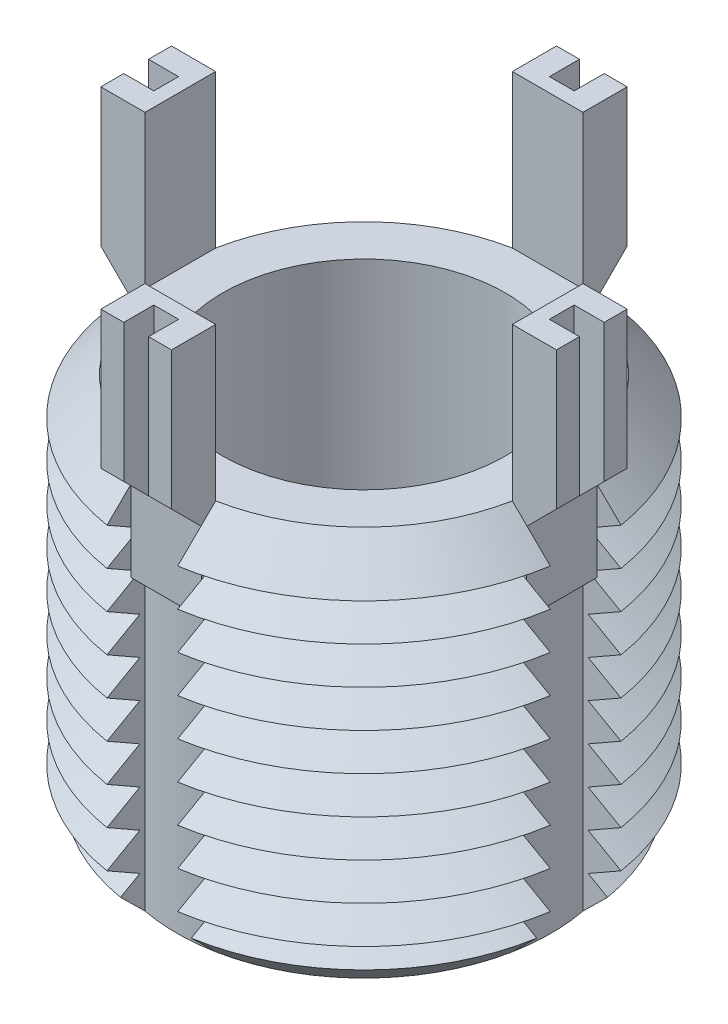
from build123d import *

# Parameters (mm, degrees)
SKETCH1_R           = 12.7
BOSS_EXTRUDE1_DEPTH = 22.098
CHAMFER1_SIZE       = 2.117
LPATTERN1_COUNT     = 9
LPATTERN1_PITCH     = 2.117
CUT_EXTRUDE1_REACH  = 30.476
CIRPATTERN1_COUNT   = 4
BOSS_EXTRUDE3_DEPTH = 2
CIRPATTERN2_COUNT   = 4
CUT_EXTRUDE3_REACH  = 37.746
SKETCH6_W           = 1.7
SKETCH6_H           = 1.4
SKETCH6_W_2         = 1.4
SKETCH6_H_2         = 1.7
SKETCH7_R           = 8
CUT_EXTRUDE4_DEPTH  = 22.098


with BuildPart() as part:
    # Sketch1 → Boss-Extrude1 (new body)
    with BuildSketch(Plane(origin=(0, 0, 0), x_dir=(1, 0, 0), z_dir=(0, 1, 0))):
        with Locations(Location((0, 0, 0), (0, 0, 270))):
            Circle(SKETCH1_R)
    extrude(amount=-BOSS_EXTRUDE1_DEPTH)

    # Chamfer1
    chamfer1_edges = [part.edges().sort_by_distance(p)[0] for p in [
        (0, 0, -12.7),
        (0, -22.098, -12.7),
    ]]
    chamfer(chamfer1_edges, length=CHAMFER1_SIZE)

    # Sketch3 → Cut-Revolve1 (revolve, cut)
    with BuildSketch(Plane(origin=(0, 0, 0), x_dir=(0, 0, -1), z_dir=(1, 0, 0))):
        Polygon((-12.7, -2.117), (-10.86662422, -3.1755), (-12.7, -4.234), align=None)
    cut_revolve1 = revolve(axis=Axis((0, 0.885892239, 0), (0, -1, 0)), mode=Mode.SUBTRACT)

    # LPattern1: Cut-Revolve1 ×9
    with Locations(*[(0, -i * LPATTERN1_PITCH, 0) for i in range(1, LPATTERN1_COUNT)]):
        add(cut_revolve1, mode=Mode.SUBTRACT)

    # Cut-Extrude1: up to this cone (the profile starts inside it)
    cut_extrude1_end = Plane(origin=(0, 0, 0), z_dir=(0, 1, 0)).offset(-32.680999) * Cone(1e-06, 96.338, 96.337999, align=(Align.CENTER, Align.CENTER, Align.MIN), mode=Mode.PRIVATE)
    # Sketch4 → Cut-Extrude1 (cut, up to the surface)
    with BuildSketch(Plane(origin=(0, 0, 0), x_dir=(1, 0, 0), z_dir=(0, 1, 0)), mode=Mode.PRIVATE) as cut_extrude1_sk1:
        with BuildLine():
            Line((-10.392299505, 2), (-12.541531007, 2))
            ThreePointArc((-12.541531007, 2), (-12.7, 0), (-12.541531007, -2))
            Line((-12.541531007, -2), (-10.392299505, -2))
            ThreePointArc((-10.392299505, -2), (-10.583, 0), (-10.392299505, 2))
        make_face()
    cut_extrude1_tool1 = extrude(cut_extrude1_sk1.sketch, amount=-CUT_EXTRUDE1_REACH, mode=Mode.PRIVATE) & cut_extrude1_end
    cut_extrude1 = cut_extrude1_tool1.solids().sort_by_distance((-11.583253, 0, 0))[0]
    add(cut_extrude1, mode=Mode.SUBTRACT)

    # CirPattern1: Cut-Extrude1 ×4 about axis
    cirpattern1_axis = Axis((0, 0, 0), (0, 1, 0))
    for i in range(1, CIRPATTERN1_COUNT):
        add(cut_extrude1.rotate(cirpattern1_axis, i * 360 / CIRPATTERN1_COUNT), mode=Mode.SUBTRACT)

    # Sketch5 → Boss-Extrude3 (add, symmetric)
    with BuildSketch(Plane(origin=(0, 0, 0), x_dir=(0, 0, -1), z_dir=(1, 0, 0))):
        Polygon((-10.392299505, 8.649), (-10.392299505, -5.351), (-11.192299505, -5.351), (-11.192299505, -0.851), (-12.892299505, 0.849), (-12.892299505, 8.649), align=None)
    boss_extrude3 = extrude(amount=BOSS_EXTRUDE3_DEPTH, both=True)

    # CirPattern2: Boss-Extrude3 ×4 about axis
    cirpattern2_axis = Axis((0, 0, 0), (0, 1, 0))
    for i in range(1, CIRPATTERN2_COUNT):
        add(boss_extrude3.rotate(cirpattern2_axis, i * 360 / CIRPATTERN2_COUNT))

    # Cut-Extrude3: up to this plane
    cut_extrude3_end = Plane(origin=(-11.192299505, -0.851, 2), z_dir=(0.7071067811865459, 0.7071067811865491, -7.406550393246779e-15))
    # Sketch6 → Cut-Extrude3 (cut, up to the surface)
    with BuildSketch(Plane(origin=(0, 8.649, 0), x_dir=(1, 0, 0), z_dir=(0, 1, 0)), mode=Mode.PRIVATE) as cut_extrude3_sk1:
        with Locations((-12.042299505, 0)):
            Rectangle(SKETCH6_W, SKETCH6_H)
    cut_extrude3_tool1 = split(extrude(cut_extrude3_sk1.sketch, amount=-CUT_EXTRUDE3_REACH, mode=Mode.PRIVATE), bisect_by=cut_extrude3_end, keep=Keep.BOTH, mode=Mode.PRIVATE)
    add(cut_extrude3_tool1.solids().sort_by_distance((-12.0423, 8.649, 0))[0], mode=Mode.SUBTRACT)
    # Sketch6 → Cut-Extrude3 (cut, up to the surface)
    with BuildSketch(Plane(origin=(0, 8.649, 0), x_dir=(1, 0, 0), z_dir=(0, 1, 0)), mode=Mode.PRIVATE) as cut_extrude3_sk2:
        with Locations((0, 12.042299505)):
            Rectangle(SKETCH6_W_2, SKETCH6_H_2)
    cut_extrude3_tool2 = split(extrude(cut_extrude3_sk2.sketch, amount=-CUT_EXTRUDE3_REACH, mode=Mode.PRIVATE), bisect_by=cut_extrude3_end, keep=Keep.BOTH, mode=Mode.PRIVATE)
    add(cut_extrude3_tool2.solids().sort_by_distance((0, 8.649, -12.0423))[0], mode=Mode.SUBTRACT)
    # Sketch6 → Cut-Extrude3 (cut, up to the surface)
    with BuildSketch(Plane(origin=(0, 8.649, 0), x_dir=(1, 0, 0), z_dir=(0, 1, 0)), mode=Mode.PRIVATE) as cut_extrude3_sk3:
        with Locations((12.042299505, 0)):
            Rectangle(SKETCH6_W, SKETCH6_H)
    cut_extrude3_tool3 = split(extrude(cut_extrude3_sk3.sketch, amount=-CUT_EXTRUDE3_REACH, mode=Mode.PRIVATE), bisect_by=cut_extrude3_end, keep=Keep.BOTH, mode=Mode.PRIVATE)
    add(cut_extrude3_tool3.solids().sort_by_distance((12.0423, 8.649, 0))[0], mode=Mode.SUBTRACT)
    # Sketch6 → Cut-Extrude3 (cut, up to the surface)
    with BuildSketch(Plane(origin=(0, 8.649, 0), x_dir=(1, 0, 0), z_dir=(0, 1, 0)), mode=Mode.PRIVATE) as cut_extrude3_sk4:
        with Locations((0, -12.042299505)):
            Rectangle(SKETCH6_W_2, SKETCH6_H_2)
    cut_extrude3_tool4 = split(extrude(cut_extrude3_sk4.sketch, amount=-CUT_EXTRUDE3_REACH, mode=Mode.PRIVATE), bisect_by=cut_extrude3_end, keep=Keep.BOTH, mode=Mode.PRIVATE)
    add(cut_extrude3_tool4.solids().sort_by_distance((0, 8.649, 12.0423))[0], mode=Mode.SUBTRACT)

    # Sketch7 → Cut-Extrude4 (cut)
    with BuildSketch(Plane(origin=(0, 0, 0), x_dir=(1, 0, 0), z_dir=(0, 1, 0))):
        with Locations(Location((0, 0, 0), (0, 0, 270))):
            Circle(SKETCH7_R)
    extrude(amount=-CUT_EXTRUDE4_DEPTH, mode=Mode.SUBTRACT)


solid = part.part
